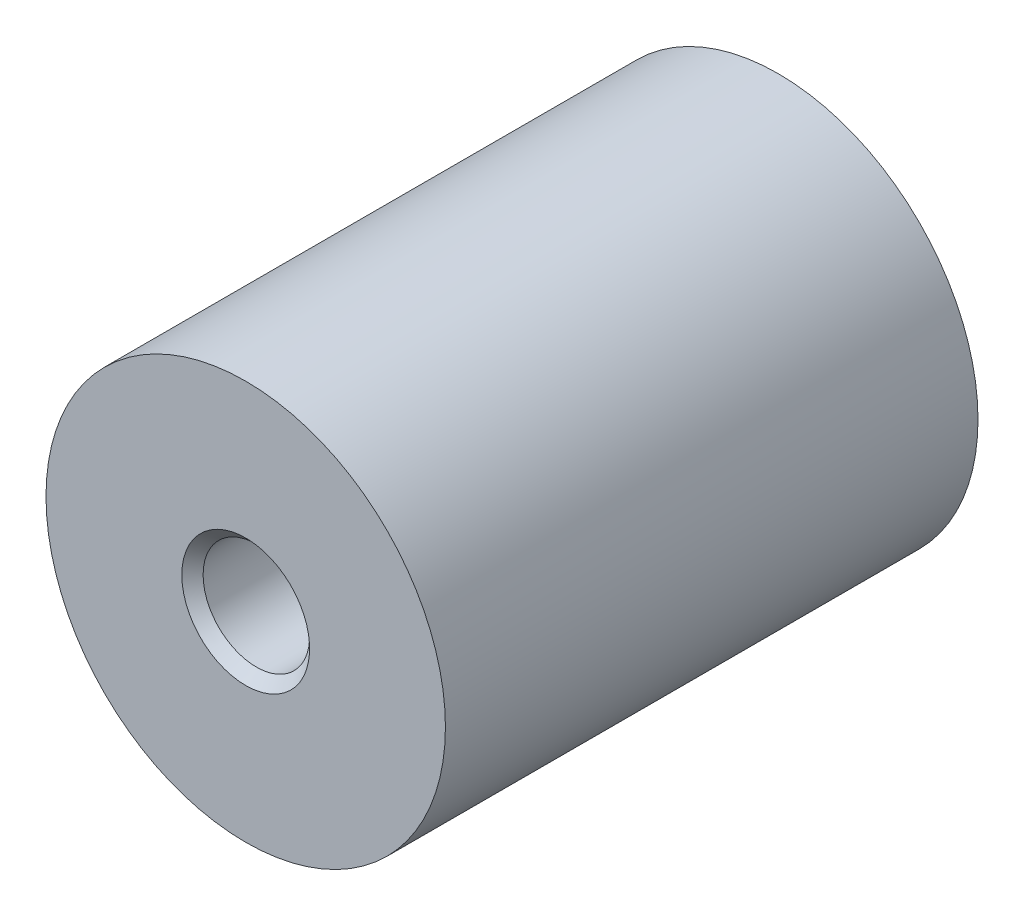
ISO-10303-21;
HEADER;
FILE_DESCRIPTION(('STEP AP214'),'2;1');
FILE_NAME('part.step','',(''),(''),'','','');
FILE_SCHEMA(('AUTOMOTIVE_DESIGN { 1 0 10303 214 1 1 1 1 }'));
ENDSEC;
DATA;
#1=APPLICATION_CONTEXT('core data for automotive mechanical design processes');
#2=APPLICATION_PROTOCOL_DEFINITION('international standard','automotive_design',2000,#1);
#3=PRODUCT_CONTEXT('',#1,'mechanical');
#4=PRODUCT('Part','Part','',(#3));
#5=PRODUCT_RELATED_PRODUCT_CATEGORY('part','',(#4));
#6=PRODUCT_DEFINITION_FORMATION('','',#4);
#7=PRODUCT_DEFINITION_CONTEXT('part definition',#1,'design');
#8=PRODUCT_DEFINITION('design','',#6,#7);
#9=PRODUCT_DEFINITION_SHAPE('','',#8);
#10=(LENGTH_UNIT() NAMED_UNIT(*) SI_UNIT(.MILLI.,.METRE.));
#11=(NAMED_UNIT(*) PLANE_ANGLE_UNIT() SI_UNIT($,.RADIAN.));
#12=(NAMED_UNIT(*) SI_UNIT($,.STERADIAN.) SOLID_ANGLE_UNIT());
#13=UNCERTAINTY_MEASURE_WITH_UNIT(LENGTH_MEASURE(1.E-05),#10,'distance_accuracy_value','');
#14=(GEOMETRIC_REPRESENTATION_CONTEXT(3) GLOBAL_UNCERTAINTY_ASSIGNED_CONTEXT((#13)) GLOBAL_UNIT_ASSIGNED_CONTEXT((#10,
#11,#12)) REPRESENTATION_CONTEXT('',''));
#15=CARTESIAN_POINT('',(0.,0.,0.));
#16=DIRECTION('',(0.,0.,1.));
#17=DIRECTION('',(1.,0.,0.));
#18=AXIS2_PLACEMENT_3D('',#15,#16,#17);
#19=CARTESIAN_POINT('',(0.,0.,0.33333333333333));
#20=DIRECTION('',(0.,0.,1.));
#21=DIRECTION('',(0.,-1.,0.));
#22=AXIS2_PLACEMENT_3D('',#19,#20,#21);
#23=CYLINDRICAL_SURFACE('',#22,7.5);
#24=CARTESIAN_POINT('',(0.,0.,0.));
#25=DIRECTION('',(0.,0.,1.));
#26=DIRECTION('',(0.,-1.,0.));
#27=AXIS2_PLACEMENT_3D('',#24,#25,#26);
#28=CIRCLE('',#27,7.5);
#29=CARTESIAN_POINT('',(0.,-7.5,0.));
#30=VERTEX_POINT('',#29);
#31=EDGE_CURVE('E23',#30,#30,#28,.T.);
#32=ORIENTED_EDGE('',*,*,#31,.T.);
#33=EDGE_LOOP('',(#32));
#34=FACE_BOUND('',#33,.T.);
#35=CARTESIAN_POINT('',(0.,0.,20.));
#36=DIRECTION('',(0.,0.,-1.));
#37=DIRECTION('',(-1.,0.,0.));
#38=AXIS2_PLACEMENT_3D('',#35,#36,#37);
#39=CIRCLE('',#38,7.5);
#40=CARTESIAN_POINT('',(-7.5,0.,20.));
#41=VERTEX_POINT('',#40);
#42=EDGE_CURVE('E32',#41,#41,#39,.T.);
#43=ORIENTED_EDGE('',*,*,#42,.T.);
#44=EDGE_LOOP('',(#43));
#45=FACE_BOUND('',#44,.T.);
#46=ADVANCED_FACE('F12',(#34,#45),#23,.T.);
#47=CARTESIAN_POINT('',(7.5,0.,0.));
#48=DIRECTION('',(0.,0.,-1.));
#49=DIRECTION('',(0.,1.,0.));
#50=AXIS2_PLACEMENT_3D('',#47,#48,#49);
#51=PLANE('',#50);
#52=CARTESIAN_POINT('',(0.,0.,0.));
#53=DIRECTION('',(0.,0.,-1.));
#54=DIRECTION('',(0.,1.,0.));
#55=AXIS2_PLACEMENT_3D('',#52,#53,#54);
#56=CIRCLE('',#55,2.4);
#57=CARTESIAN_POINT('',(0.,2.4,0.));
#58=VERTEX_POINT('',#57);
#59=EDGE_CURVE('E8',#58,#58,#56,.F.);
#60=ORIENTED_EDGE('',*,*,#59,.T.);
#61=EDGE_LOOP('',(#60));
#62=FACE_BOUND('',#61,.T.);
#63=ORIENTED_EDGE('',*,*,#31,.F.);
#64=EDGE_LOOP('',(#63));
#65=FACE_BOUND('',#64,.T.);
#66=ADVANCED_FACE('F58',(#62,#65),#51,.T.);
#67=CARTESIAN_POINT('',(0.,0.,0.));
#68=DIRECTION('',(0.,0.,1.));
#69=DIRECTION('',(0.,-1.,0.));
#70=AXIS2_PLACEMENT_3D('',#67,#68,#69);
#71=CYLINDRICAL_SURFACE('',#70,2.);
#72=CARTESIAN_POINT('',(0.,0.,0.399999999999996));
#73=DIRECTION('',(0.,0.,-1.));
#74=DIRECTION('',(0.,1.,0.));
#75=AXIS2_PLACEMENT_3D('',#72,#73,#74);
#76=CIRCLE('',#75,2.);
#77=CARTESIAN_POINT('',(0.,2.,0.399999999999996));
#78=VERTEX_POINT('',#77);
#79=EDGE_CURVE('E19',#78,#78,#76,.T.);
#80=ORIENTED_EDGE('',*,*,#79,.T.);
#81=EDGE_LOOP('',(#80));
#82=FACE_BOUND('',#81,.T.);
#83=CARTESIAN_POINT('',(0.,0.,4.));
#84=DIRECTION('',(0.,0.,-1.));
#85=DIRECTION('',(0.,1.,0.));
#86=AXIS2_PLACEMENT_3D('',#83,#84,#85);
#87=CIRCLE('',#86,2.);
#88=CARTESIAN_POINT('',(0.,2.,4.));
#89=VERTEX_POINT('',#88);
#90=EDGE_CURVE('E27',#89,#89,#87,.T.);
#91=ORIENTED_EDGE('',*,*,#90,.F.);
#92=EDGE_LOOP('',(#91));
#93=FACE_BOUND('',#92,.T.);
#94=ADVANCED_FACE('F63',(#82,#93),#71,.F.);
#95=CARTESIAN_POINT('',(0.,0.,4.));
#96=DIRECTION('',(0.,0.,-1.));
#97=DIRECTION('',(0.,1.,0.));
#98=AXIS2_PLACEMENT_3D('',#95,#96,#97);
#99=PLANE('',#98);
#100=ORIENTED_EDGE('',*,*,#90,.T.);
#101=EDGE_LOOP('',(#100));
#102=FACE_BOUND('',#101,.T.);
#103=ADVANCED_FACE('F69',(#102),#99,.T.);
#104=CARTESIAN_POINT('',(0.,0.,0.399999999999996));
#105=DIRECTION('',(0.,0.,-1.));
#106=DIRECTION('',(0.,1.,0.));
#107=AXIS2_PLACEMENT_3D('',#104,#105,#106);
#108=CONICAL_SURFACE('',#107,2.,0.785398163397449);
#109=ORIENTED_EDGE('',*,*,#59,.F.);
#110=EDGE_LOOP('',(#109));
#111=FACE_BOUND('',#110,.T.);
#112=ORIENTED_EDGE('',*,*,#79,.F.);
#113=EDGE_LOOP('',(#112));
#114=FACE_BOUND('',#113,.T.);
#115=ADVANCED_FACE('F14',(#111,#114),#108,.F.);
#116=CARTESIAN_POINT('',(0.,7.5,20.));
#117=DIRECTION('',(0.,0.,1.));
#118=DIRECTION('',(1.,0.,0.));
#119=AXIS2_PLACEMENT_3D('',#116,#117,#118);
#120=PLANE('',#119);
#121=CARTESIAN_POINT('',(0.,0.,20.));
#122=DIRECTION('',(0.,0.,-1.));
#123=DIRECTION('',(-1.,0.,0.));
#124=AXIS2_PLACEMENT_3D('',#121,#122,#123);
#125=CIRCLE('',#124,2.4);
#126=CARTESIAN_POINT('',(-2.4,0.,20.));
#127=VERTEX_POINT('',#126);
#128=EDGE_CURVE('E35',#127,#127,#125,.T.);
#129=ORIENTED_EDGE('',*,*,#128,.T.);
#130=EDGE_LOOP('',(#129));
#131=FACE_BOUND('',#130,.T.);
#132=ORIENTED_EDGE('',*,*,#42,.F.);
#133=EDGE_LOOP('',(#132));
#134=FACE_BOUND('',#133,.T.);
#135=ADVANCED_FACE('F73',(#131,#134),#120,.T.);
#136=CARTESIAN_POINT('',(0.,0.,20.));
#137=DIRECTION('',(0.,0.,1.));
#138=DIRECTION('',(1.,0.,0.));
#139=AXIS2_PLACEMENT_3D('',#136,#137,#138);
#140=CONICAL_SURFACE('',#139,2.4,0.785398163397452);
#141=CARTESIAN_POINT('',(0.,0.,19.6));
#142=DIRECTION('',(0.,0.,-1.));
#143=DIRECTION('',(-1.,0.,0.));
#144=AXIS2_PLACEMENT_3D('',#141,#142,#143);
#145=CIRCLE('',#144,2.);
#146=CARTESIAN_POINT('',(-2.,0.,19.6));
#147=VERTEX_POINT('',#146);
#148=EDGE_CURVE('E38',#147,#147,#145,.T.);
#149=ORIENTED_EDGE('',*,*,#148,.T.);
#150=EDGE_LOOP('',(#149));
#151=FACE_BOUND('',#150,.T.);
#152=ORIENTED_EDGE('',*,*,#128,.F.);
#153=EDGE_LOOP('',(#152));
#154=FACE_BOUND('',#153,.T.);
#155=ADVANCED_FACE('F55',(#151,#154),#140,.F.);
#156=CARTESIAN_POINT('',(0.,0.,0.));
#157=DIRECTION('',(0.,0.,-1.));
#158=DIRECTION('',(-1.,0.,0.));
#159=AXIS2_PLACEMENT_3D('',#156,#157,#158);
#160=CYLINDRICAL_SURFACE('',#159,2.);
#161=CARTESIAN_POINT('',(0.,0.,16.));
#162=DIRECTION('',(0.,0.,-1.));
#163=DIRECTION('',(-1.,0.,0.));
#164=AXIS2_PLACEMENT_3D('',#161,#162,#163);
#165=CIRCLE('',#164,2.);
#166=CARTESIAN_POINT('',(-2.,0.,16.));
#167=VERTEX_POINT('',#166);
#168=EDGE_CURVE('E41',#167,#167,#165,.T.);
#169=ORIENTED_EDGE('',*,*,#168,.T.);
#170=EDGE_LOOP('',(#169));
#171=FACE_BOUND('',#170,.T.);
#172=ORIENTED_EDGE('',*,*,#148,.F.);
#173=EDGE_LOOP('',(#172));
#174=FACE_BOUND('',#173,.T.);
#175=ADVANCED_FACE('F45',(#171,#174),#160,.F.);
#176=CARTESIAN_POINT('',(0.,2.,16.));
#177=DIRECTION('',(0.,0.,1.));
#178=DIRECTION('',(1.,0.,0.));
#179=AXIS2_PLACEMENT_3D('',#176,#177,#178);
#180=PLANE('',#179);
#181=ORIENTED_EDGE('',*,*,#168,.F.);
#182=EDGE_LOOP('',(#181));
#183=FACE_BOUND('',#182,.T.);
#184=ADVANCED_FACE('F48',(#183),#180,.T.);
#185=CLOSED_SHELL('',(#46,#66,#94,#103,#115,#135,#155,#175,#184));
#186=MANIFOLD_SOLID_BREP('B1',#185);
#187=ADVANCED_BREP_SHAPE_REPRESENTATION('',(#18,#186),#14);
#188=SHAPE_DEFINITION_REPRESENTATION(#9,#187);
ENDSEC;
END-ISO-10303-21;
